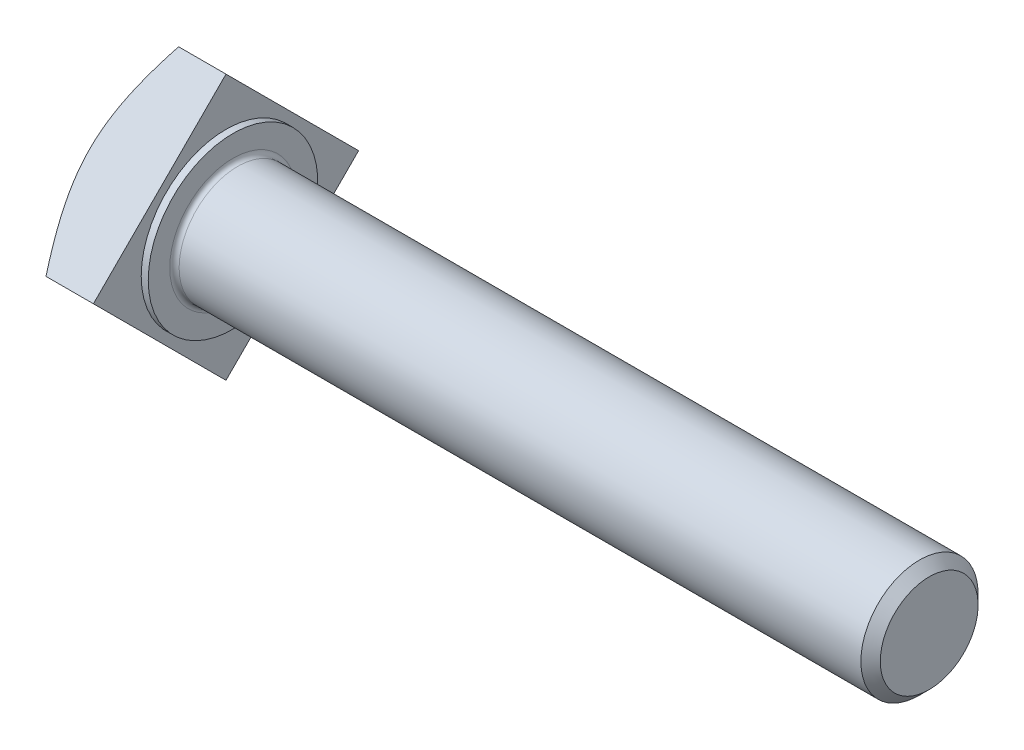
from build123d import *

# Parameters (mm, degrees)
BASEHEAD_DEPTH = 6.4
FILLET1_R      = 0.4


with BuildPart() as part:
    # BaseHeadSke → BaseHead (new body)
    with BuildSketch(Plane(origin=(0, 0, 0), x_dir=(0, 0, -1), z_dir=(1, 0, 0))):
        Polygon((0, 11.313708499), (11.313708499, 0), (0, -11.313708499), (-11.313708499, 0), align=None)
    extrude(amount=BASEHEAD_DEPTH)

    # BodySke → BaseBody (revolve)
    with BuildSketch(Plane.XY, mode=Mode.PRIVATE) as basebody_sk:
        Polygon((6.4, 0), (6.4, 7.235), (7, 7.235), (7, 5), (65.572, 5), (66.4, 4.172), (66.4, 0), align=None)
    revolve(basebody_sk.sketch.rotate(Axis((0, 0, 0), (1, 0, 0)), 90), axis=Axis((0, 0, 0), (1, 0, 0)))

    # Fillet1
    fillet1_edges = [part.edges().sort_by_distance(p)[0] for p in [
        (7, 0, -5),
    ]]
    fillet(fillet1_edges, radius=FILLET1_R)

    # HeadChamferSke → HeadChamfer (revolve, cut)
    with BuildSketch(Plane.XY, mode=Mode.PRIVATE) as headchamfer_sk:
        Polygon((0, 11.313708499), (0, 7.235), (2.35484345, 11.313708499), align=None)
    revolve(headchamfer_sk.sketch.rotate(Axis((0, 0, 0), (1, 0, 0)), 90), axis=Axis((0, 0, 0), (1, 0, 0)), mode=Mode.SUBTRACT)


solid = part.part
